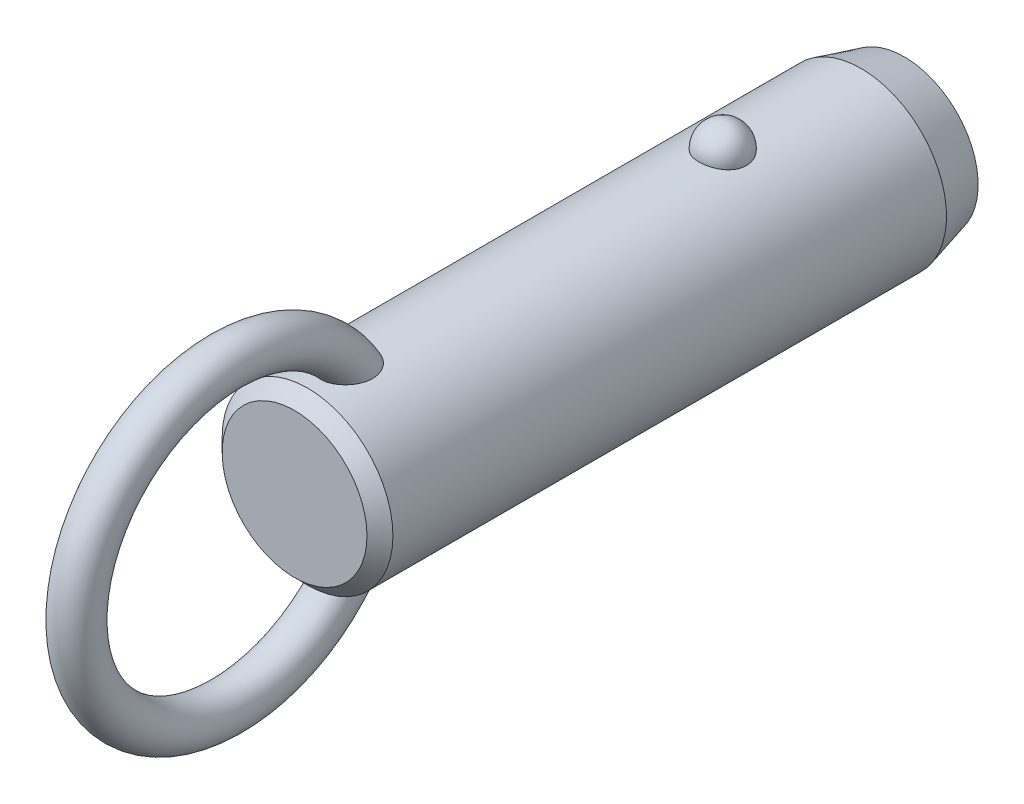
ISO-10303-21;
HEADER;
FILE_DESCRIPTION(('STEP AP214'),'2;1');
FILE_NAME('part.step','',(''),(''),'','','');
FILE_SCHEMA(('AUTOMOTIVE_DESIGN { 1 0 10303 214 1 1 1 1 }'));
ENDSEC;
DATA;
#1=APPLICATION_CONTEXT('core data for automotive mechanical design processes');
#2=APPLICATION_PROTOCOL_DEFINITION('international standard','automotive_design',2000,#1);
#3=PRODUCT_CONTEXT('',#1,'mechanical');
#4=PRODUCT('Part','Part','',(#3));
#5=PRODUCT_RELATED_PRODUCT_CATEGORY('part','',(#4));
#6=PRODUCT_DEFINITION_FORMATION('','',#4);
#7=PRODUCT_DEFINITION_CONTEXT('part definition',#1,'design');
#8=PRODUCT_DEFINITION('design','',#6,#7);
#9=PRODUCT_DEFINITION_SHAPE('','',#8);
#10=(LENGTH_UNIT() NAMED_UNIT(*) SI_UNIT(.MILLI.,.METRE.));
#11=(NAMED_UNIT(*) PLANE_ANGLE_UNIT() SI_UNIT($,.RADIAN.));
#12=(NAMED_UNIT(*) SI_UNIT($,.STERADIAN.) SOLID_ANGLE_UNIT());
#13=UNCERTAINTY_MEASURE_WITH_UNIT(LENGTH_MEASURE(1.E-05),#10,'distance_accuracy_value','');
#14=(GEOMETRIC_REPRESENTATION_CONTEXT(3) GLOBAL_UNCERTAINTY_ASSIGNED_CONTEXT((#13)) GLOBAL_UNIT_ASSIGNED_CONTEXT((#10,
#11,#12)) REPRESENTATION_CONTEXT('',''));
#15=CARTESIAN_POINT('',(0.,0.,0.));
#16=DIRECTION('',(0.,0.,1.));
#17=DIRECTION('',(1.,0.,0.));
#18=AXIS2_PLACEMENT_3D('',#15,#16,#17);
#19=CARTESIAN_POINT('',(0.,0.,27.9));
#20=DIRECTION('',(0.,0.,-1.));
#21=DIRECTION('',(-1.,0.,0.));
#22=AXIS2_PLACEMENT_3D('',#19,#20,#21);
#23=CYLINDRICAL_SURFACE('',#22,7.9);
#24=CARTESIAN_POINT('',(2.1785689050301,7.59367088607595,-2.20000000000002));
#25=CARTESIAN_POINT('',(2.17856679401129,7.59367269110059,-2.07701843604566));
#26=CARTESIAN_POINT('',(2.16853481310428,7.59657145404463,-1.95401006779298));
#27=CARTESIAN_POINT('',(2.12864689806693,7.607843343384,-1.71147811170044));
#28=CARTESIAN_POINT('',(2.09878338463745,7.61621856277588,-1.5919558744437));
#29=CARTESIAN_POINT('',(2.0199931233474,7.63749180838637,-1.35985638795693));
#30=CARTESIAN_POINT('',(1.97107475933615,7.6503878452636,-1.24727610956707));
#31=CARTESIAN_POINT('',(1.85539377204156,7.67926115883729,-1.03213234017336));
#32=CARTESIAN_POINT('',(1.78863158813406,7.69523835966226,-0.929568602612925));
#33=CARTESIAN_POINT('',(1.63856494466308,7.7285848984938,-0.73678633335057));
#34=CARTESIAN_POINT('',(1.55518140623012,7.7459606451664,-0.646630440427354));
#35=CARTESIAN_POINT('',(1.37422937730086,7.78009978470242,-0.481747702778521));
#36=CARTESIAN_POINT('',(1.27666086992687,7.79686317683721,-0.407020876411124));
#37=CARTESIAN_POINT('',(1.07024728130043,7.82786153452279,-0.275278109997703));
#38=CARTESIAN_POINT('',(0.961434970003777,7.84210353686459,-0.218212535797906));
#39=CARTESIAN_POINT('',(0.735351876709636,7.86652194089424,-0.123146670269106));
#40=CARTESIAN_POINT('',(0.618082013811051,7.87669878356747,-0.0851443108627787));
#41=CARTESIAN_POINT('',(0.380637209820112,7.89170521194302,-0.0298158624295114));
#42=CARTESIAN_POINT('',(0.260550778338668,7.89662650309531,-0.0121347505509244));
#43=CARTESIAN_POINT('',(0.0190117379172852,7.90090003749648,0.00324379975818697));
#44=CARTESIAN_POINT('',(-0.102440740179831,7.90025280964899,0.000943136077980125));
#45=CARTESIAN_POINT('',(-0.341452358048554,7.89351056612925,-0.0233955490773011));
#46=CARTESIAN_POINT('',(-0.459042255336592,7.88749257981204,-0.0451545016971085));
#47=CARTESIAN_POINT('',(-0.688796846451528,7.87075812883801,-0.107408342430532));
#48=CARTESIAN_POINT('',(-0.800961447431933,7.86004158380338,-0.14790355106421));
#49=CARTESIAN_POINT('',(-1.01743634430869,7.83497131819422,-0.246799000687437));
#50=CARTESIAN_POINT('',(-1.12169791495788,7.82059709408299,-0.305300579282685));
#51=CARTESIAN_POINT('',(-1.31891765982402,7.78976470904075,-0.43854939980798));
#52=CARTESIAN_POINT('',(-1.41187469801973,7.77330633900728,-0.513298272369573));
#53=CARTESIAN_POINT('',(-1.58577142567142,7.73972434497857,-0.678622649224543));
#54=CARTESIAN_POINT('',(-1.66645140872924,7.72259402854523,-0.769470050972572));
#55=CARTESIAN_POINT('',(-1.81161503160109,7.68983776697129,-0.963538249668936));
#56=CARTESIAN_POINT('',(-1.87609753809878,7.6742119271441,-1.0667599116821));
#57=CARTESIAN_POINT('',(-1.98790138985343,7.6460202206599,-1.28401170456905));
#58=CARTESIAN_POINT('',(-2.03501994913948,7.63349104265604,-1.39815107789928));
#59=CARTESIAN_POINT('',(-2.10986724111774,7.6131449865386,-1.6330178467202));
#60=CARTESIAN_POINT('',(-2.1375965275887,7.60532797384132,-1.75374505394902));
#61=CARTESIAN_POINT('',(-2.17289256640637,7.5953195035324,-1.99782562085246));
#62=CARTESIAN_POINT('',(-2.18054294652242,7.59310471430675,-2.12116592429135));
#63=CARTESIAN_POINT('',(-2.17572919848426,7.59448538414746,-2.36741799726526));
#64=CARTESIAN_POINT('',(-2.1632656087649,7.59808068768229,-2.49032977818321));
#65=CARTESIAN_POINT('',(-2.11865035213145,7.61064035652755,-2.73161015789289));
#66=CARTESIAN_POINT('',(-2.08659579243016,7.61957823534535,-2.84999812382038));
#67=CARTESIAN_POINT('',(-2.00367799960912,7.64179982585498,-3.07955956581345));
#68=CARTESIAN_POINT('',(-1.9528140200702,7.65508371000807,-3.19073275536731));
#69=CARTESIAN_POINT('',(-1.83321113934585,7.68460381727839,-3.40337899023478));
#70=CARTESIAN_POINT('',(-1.76437735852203,7.70085556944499,-3.5047965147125));
#71=CARTESIAN_POINT('',(-1.61069526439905,7.73445734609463,-3.69446912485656));
#72=CARTESIAN_POINT('',(-1.52584634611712,7.75180741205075,-3.78272371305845));
#73=CARTESIAN_POINT('',(-1.34198059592,7.78574608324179,-3.94393987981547));
#74=CARTESIAN_POINT('',(-1.24291308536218,7.80233167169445,-4.01684434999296));
#75=CARTESIAN_POINT('',(-1.03352039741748,7.83281625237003,-4.14489386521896));
#76=CARTESIAN_POINT('',(-0.92319600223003,7.84671543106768,-4.20004014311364));
#77=CARTESIAN_POINT('',(-0.695822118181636,7.87011575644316,-4.29042017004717));
#78=CARTESIAN_POINT('',(-0.578872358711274,7.87966903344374,-4.32589112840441));
#79=CARTESIAN_POINT('',(-0.340410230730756,7.8935652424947,-4.37692226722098));
#80=CARTESIAN_POINT('',(-0.218898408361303,7.89790879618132,-4.39248482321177));
#81=CARTESIAN_POINT('',(0.0228107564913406,7.90087453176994,-4.40314405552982));
#82=CARTESIAN_POINT('',(0.142990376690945,7.89960185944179,-4.39861683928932));
#83=CARTESIAN_POINT('',(0.380829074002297,7.89171262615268,-4.37008293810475));
#84=CARTESIAN_POINT('',(0.498488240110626,7.8850962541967,-4.34607694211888));
#85=CARTESIAN_POINT('',(0.727535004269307,7.86726442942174,-4.27939317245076));
#86=CARTESIAN_POINT('',(0.838944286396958,7.85606616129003,-4.23678512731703));
#87=CARTESIAN_POINT('',(1.05295421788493,7.83025654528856,-4.13408348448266));
#88=CARTESIAN_POINT('',(1.15555431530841,7.81564498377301,-4.07398879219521));
#89=CARTESIAN_POINT('',(1.35076763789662,7.7843022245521,-3.93687432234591));
#90=CARTESIAN_POINT('',(1.4432046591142,7.76754209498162,-3.85961036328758));
#91=CARTESIAN_POINT('',(1.6139111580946,7.73387857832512,-3.69076949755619));
#92=CARTESIAN_POINT('',(1.6921781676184,7.71697516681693,-3.59919010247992));
#93=CARTESIAN_POINT('',(1.83380875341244,7.6845643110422,-3.40247278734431));
#94=CARTESIAN_POINT('',(1.89689280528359,7.66908588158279,-3.29712873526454));
#95=CARTESIAN_POINT('',(2.0047823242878,7.64159441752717,-3.07707931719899));
#96=CARTESIAN_POINT('',(2.0495945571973,7.62958010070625,-2.96237743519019));
#97=CARTESIAN_POINT('',(2.11580183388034,7.61146617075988,-2.74040519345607));
#98=CARTESIAN_POINT('',(2.13929812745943,7.60484503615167,-2.63379846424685));
#99=CARTESIAN_POINT('',(2.17068242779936,7.59594664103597,-2.4181348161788));
#100=CARTESIAN_POINT('',(2.17857077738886,7.59366928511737,-2.30907795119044));
#101=CARTESIAN_POINT('',(2.1785689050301,7.59367088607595,-2.20000000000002));
#102=B_SPLINE_CURVE_WITH_KNOTS('',3,(#24,#25,#26,#27,#28,#29,#30,#31,#32,#33,#34,#35,#36,#37,
#38,#39,#40,#41,#42,#43,#44,#45,#46,#47,#48,#49,#50,#51,#52,#53,#54,#55,#56,#57,#58,#59,#60,#61,
#62,#63,#64,#65,#66,#67,#68,#69,#70,#71,#72,#73,#74,#75,#76,#77,#78,#79,#80,#81,#82,#83,#84,#85,
#86,#87,#88,#89,#90,#91,#92,#93,#94,#95,#96,#97,#98,#99,#100,#101),.UNSPECIFIED.,.T.,.F.,(4,2,2,
2,2,2,2,2,2,2,2,2,2,2,2,2,2,2,2,2,2,2,2,2,2,2,2,2,2,2,2,2,2,2,2,2,2,2,4),(0.,0.368552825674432,
0.737246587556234,1.10577831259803,1.4743009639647,1.8446206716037,2.21494081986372,
2.5842105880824,2.95344028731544,3.31611630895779,3.67875788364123,4.03628044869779,
4.39380913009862,4.75338791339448,5.11300280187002,5.47939989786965,5.8458226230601,
6.21639834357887,6.58696347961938,6.95598276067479,7.32499216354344,7.69218715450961,
8.0593967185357,8.42858578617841,8.79778880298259,9.16834203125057,9.5388695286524,
9.90482699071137,10.2707407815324,10.6298333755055,10.9889132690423,11.3466585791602,
11.7044262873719,12.0676511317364,12.4309391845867,12.8004764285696,13.1698767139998,
13.4967701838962,13.8236564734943),.UNSPECIFIED.);
#103=CARTESIAN_POINT('',(2.1785689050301,7.59367088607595,-2.20000000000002));
#104=VERTEX_POINT('',#103);
#105=EDGE_CURVE('E41',#104,#104,#102,.T.);
#106=ORIENTED_EDGE('',*,*,#105,.T.);
#107=EDGE_LOOP('',(#106));
#108=FACE_BOUND('',#107,.T.);
#109=CARTESIAN_POINT('',(0.,0.,36.22));
#110=DIRECTION('',(0.,0.,1.));
#111=DIRECTION('',(1.,0.,0.));
#112=AXIS2_PLACEMENT_3D('',#109,#110,#111);
#113=CIRCLE('',#112,7.9);
#114=CARTESIAN_POINT('',(7.9,0.,36.22));
#115=VERTEX_POINT('',#114);
#116=EDGE_CURVE('E10',#115,#115,#113,.F.);
#117=ORIENTED_EDGE('',*,*,#116,.T.);
#118=EDGE_LOOP('',(#117));
#119=FACE_BOUND('',#118,.T.);
#120=CARTESIAN_POINT('',(-0.630969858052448,-7.87476203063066,30.1124322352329));
#121=CARTESIAN_POINT('',(-0.734180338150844,-7.8664899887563,30.147285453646));
#122=CARTESIAN_POINT('',(-0.834476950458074,-7.85639291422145,30.1908160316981));
#123=CARTESIAN_POINT('',(-1.0262035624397,-7.83366343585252,30.294094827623));
#124=CARTESIAN_POINT('',(-1.1176141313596,-7.82102565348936,30.3538775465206));
#125=CARTESIAN_POINT('',(-1.28877277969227,-7.79464922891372,30.4878390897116));
#126=CARTESIAN_POINT('',(-1.36854014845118,-7.78091246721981,30.561993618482));
#127=CARTESIAN_POINT('',(-1.51461521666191,-7.75380398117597,30.7224941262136));
#128=CARTESIAN_POINT('',(-1.58092966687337,-7.74043207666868,30.8088339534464));
#129=CARTESIAN_POINT('',(-1.70019064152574,-7.71512522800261,30.9929784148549));
#130=CARTESIAN_POINT('',(-1.75284037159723,-7.70322473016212,31.0909792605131));
#131=CARTESIAN_POINT('',(-1.84263464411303,-7.68224112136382,31.2941029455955));
#132=CARTESIAN_POINT('',(-1.87977299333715,-7.6731591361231,31.3992286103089));
#133=CARTESIAN_POINT('',(-1.94152728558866,-7.65777930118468,31.6232849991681));
#134=CARTESIAN_POINT('',(-1.96475471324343,-7.65179654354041,31.7426167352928));
#135=CARTESIAN_POINT('',(-1.99449499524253,-7.64409642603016,31.9834298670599));
#136=CARTESIAN_POINT('',(-2.0010005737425,-7.64238092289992,32.1049121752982));
#137=CARTESIAN_POINT('',(-1.99856014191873,-7.64302120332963,32.3683409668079));
#138=CARTESIAN_POINT('',(-1.98680021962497,-7.64611845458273,32.5102565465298));
#139=CARTESIAN_POINT('',(-1.94457772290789,-7.65696186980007,32.7911188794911));
#140=CARTESIAN_POINT('',(-1.91409393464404,-7.66471330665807,32.9300620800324));
#141=CARTESIAN_POINT('',(-1.82768670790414,-7.68582947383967,33.231939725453));
#142=CARTESIAN_POINT('',(-1.76772963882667,-7.70003779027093,33.393686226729));
#143=CARTESIAN_POINT('',(-1.65998501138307,-7.72371550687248,33.6276956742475));
#144=CARTESIAN_POINT('',(-1.62107967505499,-7.73200670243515,33.7042974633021));
#145=CARTESIAN_POINT('',(-1.53727726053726,-7.7491037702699,33.8540798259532));
#146=CARTESIAN_POINT('',(-1.4923821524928,-7.75790947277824,33.9272615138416));
#147=CARTESIAN_POINT('',(-1.37397050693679,-7.77993338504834,34.1028838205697));
#148=CARTESIAN_POINT('',(-1.29690364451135,-7.79328473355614,34.2029557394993));
#149=CARTESIAN_POINT('',(-1.12885487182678,-7.81939266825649,34.3907147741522));
#150=CARTESIAN_POINT('',(-1.03789926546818,-7.83215032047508,34.4784247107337));
#151=CARTESIAN_POINT('',(-0.869532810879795,-7.85231710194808,34.6134148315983));
#152=CARTESIAN_POINT('',(-0.795716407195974,-7.86021093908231,34.665076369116));
#153=CARTESIAN_POINT('',(-0.640813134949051,-7.87434920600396,34.7563815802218));
#154=CARTESIAN_POINT('',(-0.559737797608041,-7.88059619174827,34.7960438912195));
#155=CARTESIAN_POINT('',(-0.406456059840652,-7.88984116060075,34.8543008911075));
#156=CARTESIAN_POINT('',(-0.335227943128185,-7.89321892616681,34.8753848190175));
#157=CARTESIAN_POINT('',(-0.190193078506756,-7.89804235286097,34.9054141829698));
#158=CARTESIAN_POINT('',(-0.116388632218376,-7.89948969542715,34.9143701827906));
#159=CARTESIAN_POINT('',(0.0318414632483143,-7.90028409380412,34.9192915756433));
#160=CARTESIAN_POINT('',(0.106268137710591,-7.89962640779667,34.9152276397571));
#161=CARTESIAN_POINT('',(0.253290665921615,-7.8962818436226,34.8944615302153));
#162=CARTESIAN_POINT('',(0.325885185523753,-7.8935935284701,34.8777504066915));
#163=CARTESIAN_POINT('',(0.481441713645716,-7.88577340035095,34.8287380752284));
#164=CARTESIAN_POINT('',(0.563611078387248,-7.88026321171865,34.794005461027));
#165=CARTESIAN_POINT('',(0.721129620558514,-7.86741729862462,34.7117965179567));
#166=CARTESIAN_POINT('',(0.796466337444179,-7.86007832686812,34.6642975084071));
#167=CARTESIAN_POINT('',(0.97145628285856,-7.84073285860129,34.536513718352));
#168=CARTESIAN_POINT('',(1.06719686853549,-7.82809461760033,34.4510047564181));
#169=CARTESIAN_POINT('',(1.24418921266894,-7.80192439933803,34.266232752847));
#170=CARTESIAN_POINT('',(1.32540832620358,-7.78839049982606,34.1669395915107));
#171=CARTESIAN_POINT('',(1.45199971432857,-7.76559693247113,33.9895760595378));
#172=CARTESIAN_POINT('',(1.5008564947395,-7.75626094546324,33.9139542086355));
#173=CARTESIAN_POINT('',(1.59197749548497,-7.7380727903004,33.7587428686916));
#174=CARTESIAN_POINT('',(1.63423919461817,-7.72922080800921,33.6791518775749));
#175=CARTESIAN_POINT('',(1.71222612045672,-7.71231959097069,33.5166640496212));
#176=CARTESIAN_POINT('',(1.7479451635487,-7.70427111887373,33.4337641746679));
#177=CARTESIAN_POINT('',(1.81270113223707,-7.68929240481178,33.2652967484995));
#178=CARTESIAN_POINT('',(1.84173789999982,-7.68236218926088,33.1797291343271));
#179=CARTESIAN_POINT('',(1.89322698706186,-7.6698375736,33.0052870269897));
#180=CARTESIAN_POINT('',(1.91558744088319,-7.66426199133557,32.9163838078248));
#181=CARTESIAN_POINT('',(1.95281367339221,-7.65485915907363,32.7369696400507));
#182=CARTESIAN_POINT('',(1.96767946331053,-7.65103190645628,32.6464586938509));
#183=CARTESIAN_POINT('',(2.00021456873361,-7.64262981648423,32.3737320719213));
#184=CARTESIAN_POINT('',(2.00600691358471,-7.6410871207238,32.1897099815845));
#185=CARTESIAN_POINT('',(1.98445334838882,-7.64669564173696,31.8765019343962));
#186=CARTESIAN_POINT('',(1.96607186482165,-7.65149688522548,31.746618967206));
#187=CARTESIAN_POINT('',(1.90884967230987,-7.6659762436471,31.4916321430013));
#188=CARTESIAN_POINT('',(1.87002101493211,-7.67565148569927,31.366525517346));
#189=CARTESIAN_POINT('',(1.77063986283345,-7.69918471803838,31.1245401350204));
#190=CARTESIAN_POINT('',(1.7099372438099,-7.71307150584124,31.0077250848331));
#191=CARTESIAN_POINT('',(1.56733070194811,-7.74330306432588,30.7881444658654));
#192=CARTESIAN_POINT('',(1.4854369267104,-7.75964665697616,30.6853722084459));
#193=CARTESIAN_POINT('',(1.31346177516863,-7.79047523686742,30.5093800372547));
#194=CARTESIAN_POINT('',(1.22547278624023,-7.80495298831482,30.4341066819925));
#195=CARTESIAN_POINT('',(1.03724352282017,-7.83218597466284,30.3004864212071));
#196=CARTESIAN_POINT('',(0.937008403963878,-7.84494192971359,30.2421324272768));
#197=CARTESIAN_POINT('',(0.733599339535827,-7.86649045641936,30.1470270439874));
#198=CARTESIAN_POINT('',(0.630941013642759,-7.87547134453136,30.1092109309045));
#199=CARTESIAN_POINT('',(0.420465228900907,-7.88950708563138,30.0511160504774));
#200=CARTESIAN_POINT('',(0.312645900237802,-7.89456050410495,30.0308436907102));
#201=CARTESIAN_POINT('',(0.0960869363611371,-7.9001518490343,30.0084559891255));
#202=CARTESIAN_POINT('',(-0.012634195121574,-7.90073226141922,30.0061698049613));
#203=CARTESIAN_POINT('',(-0.228766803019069,-7.89742350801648,30.0193678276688));
#204=CARTESIAN_POINT('',(-0.336180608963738,-7.89354403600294,30.0348134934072));
#205=CARTESIAN_POINT('',(-0.473410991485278,-7.88586871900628,30.0662177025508));
#206=CARTESIAN_POINT('',(-0.505257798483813,-7.88388984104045,30.0743541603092));
#207=CARTESIAN_POINT('',(-0.568481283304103,-7.87958326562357,30.0922083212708));
#208=CARTESIAN_POINT('',(-0.599857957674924,-7.87725556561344,30.1019260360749));
#209=CARTESIAN_POINT('',(-0.630969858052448,-7.87476203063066,30.1124322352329));
#210=B_SPLINE_CURVE_WITH_KNOTS('',3,(#120,#121,#122,#123,#124,#125,#126,#127,#128,#129,#130,
#131,#132,#133,#134,#135,#136,#137,#138,#139,#140,#141,#142,#143,#144,#145,#146,#147,#148,#149,
#150,#151,#152,#153,#154,#155,#156,#157,#158,#159,#160,#161,#162,#163,#164,#165,#166,#167,#168,
#169,#170,#171,#172,#173,#174,#175,#176,#177,#178,#179,#180,#181,#182,#183,#184,#185,#186,#187,
#188,#189,#190,#191,#192,#193,#194,#195,#196,#197,#198,#199,#200,#201,#202,#203,#204,#205,#206,
#207,#208,#209),.UNSPECIFIED.,.T.,.F.,(4,2,2,2,2,2,2,2,2,2,2,2,2,2,2,2,2,2,2,2,2,2,2,2,2,2,2,2,
2,2,2,2,2,2,2,2,2,2,2,2,2,2,2,2,4),(0.,0.327622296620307,0.655945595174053,0.983718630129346,
1.3113267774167,1.64554655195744,1.97989964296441,2.34365728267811,2.70757317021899,
3.13333684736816,3.55958380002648,4.07655306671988,4.33527897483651,4.59391999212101,
4.97382437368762,5.35301797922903,5.62348245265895,5.89352465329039,6.11565959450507,
6.33760092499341,6.56004255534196,6.78264174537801,7.04930844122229,7.31645206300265,
7.70130871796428,8.08701995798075,8.35824509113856,8.62957365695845,8.90115735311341,
9.17274746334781,9.44791855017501,9.72308922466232,10.2715298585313,10.6638393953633,
11.0559179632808,11.4507403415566,11.845374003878,12.1936425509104,12.5417649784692,
12.8695063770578,13.1973674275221,13.5221104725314,13.8461490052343,13.9449071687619,
14.0436660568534),.UNSPECIFIED.);
#211=CARTESIAN_POINT('',(-0.630969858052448,-7.87476203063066,30.1124322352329));
#212=VERTEX_POINT('',#211);
#213=EDGE_CURVE('E60',#212,#212,#210,.T.);
#214=ORIENTED_EDGE('',*,*,#213,.T.);
#215=EDGE_LOOP('',(#214));
#216=FACE_BOUND('',#215,.T.);
#217=CARTESIAN_POINT('',(-0.630969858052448,7.87476203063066,30.1124322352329));
#218=CARTESIAN_POINT('',(-0.528918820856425,7.88293636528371,30.0779798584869));
#219=CARTESIAN_POINT('',(-0.423745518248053,7.88934810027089,30.051915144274));
#220=CARTESIAN_POINT('',(-0.210236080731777,7.8979273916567,30.0172825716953));
#221=CARTESIAN_POINT('',(-0.101893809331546,7.90008607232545,30.0087513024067));
#222=CARTESIAN_POINT('',(0.114660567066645,7.89990877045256,30.0094570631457));
#223=CARTESIAN_POINT('',(0.22287270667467,7.89757640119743,30.0186798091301));
#224=CARTESIAN_POINT('',(0.436107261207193,7.88867538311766,30.0546525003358));
#225=CARTESIAN_POINT('',(0.541131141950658,7.8821087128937,30.0813942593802));
#226=CARTESIAN_POINT('',(0.745085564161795,7.86545130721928,30.1517561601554));
#227=CARTESIAN_POINT('',(0.844015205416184,7.85536005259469,30.1953787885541));
#228=CARTESIAN_POINT('',(1.03299167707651,7.83275153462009,30.2983796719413));
#229=CARTESIAN_POINT('',(1.12303841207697,7.8202342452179,30.3577580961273));
#230=CARTESIAN_POINT('',(1.29214734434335,7.79408219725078,30.4908647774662));
#231=CARTESIAN_POINT('',(1.37116907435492,7.78044359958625,30.5646436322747));
#232=CARTESIAN_POINT('',(1.51597677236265,7.75353170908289,30.7242353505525));
#233=CARTESIAN_POINT('',(1.58176261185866,7.74025841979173,30.8100483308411));
#234=CARTESIAN_POINT('',(1.70057386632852,7.71504069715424,30.993644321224));
#235=CARTESIAN_POINT('',(1.75320073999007,7.7031425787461,31.0916906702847));
#236=CARTESIAN_POINT('',(1.8429376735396,7.68216822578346,31.2948931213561));
#237=CARTESIAN_POINT('',(1.88004278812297,7.67309289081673,31.4000514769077));
#238=CARTESIAN_POINT('',(1.9417232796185,7.6577294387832,31.6241671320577));
#239=CARTESIAN_POINT('',(1.96491037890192,7.65175648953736,31.7435248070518));
#240=CARTESIAN_POINT('',(1.9945689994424,7.64407702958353,31.9843848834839));
#241=CARTESIAN_POINT('',(2.00103304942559,7.64237242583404,32.1058882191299));
#242=CARTESIAN_POINT('',(1.99850166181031,7.64303650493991,32.3693688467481));
#243=CARTESIAN_POINT('',(1.98669038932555,7.64614714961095,32.5113141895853));
#244=CARTESIAN_POINT('',(1.94436120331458,7.6570170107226,32.7922287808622));
#245=CARTESIAN_POINT('',(1.91382203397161,7.66478150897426,32.9311944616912));
#246=CARTESIAN_POINT('',(1.82728754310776,7.68592483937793,33.2331110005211));
#247=CARTESIAN_POINT('',(1.76725778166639,7.7001468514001,33.3948721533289));
#248=CARTESIAN_POINT('',(1.65939700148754,7.72384204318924,33.6288914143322));
#249=CARTESIAN_POINT('',(1.62045187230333,7.73213852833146,33.7054942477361));
#250=CARTESIAN_POINT('',(1.5365668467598,7.74924489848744,33.8552737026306));
#251=CARTESIAN_POINT('',(1.49162892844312,7.75805461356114,33.9284514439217));
#252=CARTESIAN_POINT('',(1.37317698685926,7.78007342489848,34.1039520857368));
#253=CARTESIAN_POINT('',(1.29612360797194,7.79341423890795,34.2039112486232));
#254=CARTESIAN_POINT('',(1.12812043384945,7.81949839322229,34.3914508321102));
#255=CARTESIAN_POINT('',(1.03719688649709,7.83224280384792,34.4790540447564));
#256=CARTESIAN_POINT('',(0.868871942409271,7.85239026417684,34.6138971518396));
#257=CARTESIAN_POINT('',(0.795056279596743,7.86027769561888,34.6655113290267));
#258=CARTESIAN_POINT('',(0.640160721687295,7.87440222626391,34.7567201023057));
#259=CARTESIAN_POINT('',(0.559092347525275,7.88064188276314,34.7963333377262));
#260=CARTESIAN_POINT('',(0.40582092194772,7.8898738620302,34.8545056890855));
#261=CARTESIAN_POINT('',(0.334594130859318,7.89324577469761,34.8755523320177));
#262=CARTESIAN_POINT('',(0.189568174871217,7.89805733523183,34.9055070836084));
#263=CARTESIAN_POINT('',(0.115771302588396,7.89949866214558,34.9144257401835));
#264=CARTESIAN_POINT('',(-0.0324359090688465,7.90028156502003,34.9192758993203));
#265=CARTESIAN_POINT('',(-0.106847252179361,7.89961843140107,34.9151782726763));
#266=CARTESIAN_POINT('',(-0.253834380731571,7.8962642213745,34.8943519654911));
#267=CARTESIAN_POINT('',(-0.326408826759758,7.89357170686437,34.8776143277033));
#268=CARTESIAN_POINT('',(-0.481962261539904,7.88574179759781,34.8285391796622));
#269=CARTESIAN_POINT('',(-0.564145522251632,7.88022507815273,34.7937638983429));
#270=CARTESIAN_POINT('',(-0.721685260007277,7.8673664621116,34.7114686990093));
#271=CARTESIAN_POINT('',(-0.797029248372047,7.8600213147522,34.6639260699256));
#272=CARTESIAN_POINT('',(-0.972044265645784,7.84066026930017,34.5360267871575));
#273=CARTESIAN_POINT('',(-1.06779803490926,7.82801274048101,34.4504436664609));
#274=CARTESIAN_POINT('',(-1.24480531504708,7.80182621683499,34.2655223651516));
#275=CARTESIAN_POINT('',(-1.32602618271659,7.78828530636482,34.1661540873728));
#276=CARTESIAN_POINT('',(-1.45259834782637,7.76548487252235,33.9886806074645));
#277=CARTESIAN_POINT('',(-1.50143856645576,7.75614818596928,33.9130252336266));
#278=CARTESIAN_POINT('',(-1.59252410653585,7.73796020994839,33.7577484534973));
#279=CARTESIAN_POINT('',(-1.63476690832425,7.72910910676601,33.6781255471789));
#280=CARTESIAN_POINT('',(-1.71271318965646,7.71221133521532,33.5155750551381));
#281=CARTESIAN_POINT('',(-1.74841047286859,7.70416543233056,33.4326444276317));
#282=CARTESIAN_POINT('',(-1.81311929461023,7.68919371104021,33.2641168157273));
#283=CARTESIAN_POINT('',(-1.84213067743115,7.6822679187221,33.1785197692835));
#284=CARTESIAN_POINT('',(-1.89356259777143,7.66975461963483,33.0040254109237));
#285=CARTESIAN_POINT('',(-1.91589165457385,7.66418586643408,32.9150995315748));
#286=CARTESIAN_POINT('',(-1.95305070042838,7.65479859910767,32.7356424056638));
#287=CARTESIAN_POINT('',(-1.96788069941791,7.65098008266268,32.6451111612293));
#288=CARTESIAN_POINT('',(-2.00030078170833,7.64260704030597,32.3723270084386));
#289=CARTESIAN_POINT('',(-2.00600576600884,7.64108760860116,32.1882718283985));
#290=CARTESIAN_POINT('',(-1.98428483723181,7.64673945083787,31.8750800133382));
#291=CARTESIAN_POINT('',(-1.96583698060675,7.6515575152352,31.7452400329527));
#292=CARTESIAN_POINT('',(-1.90848948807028,7.66606613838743,31.4903619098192));
#293=CARTESIAN_POINT('',(-1.86960376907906,7.67575338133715,31.365320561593));
#294=CARTESIAN_POINT('',(-1.7701342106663,7.6993013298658,31.1235009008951));
#295=CARTESIAN_POINT('',(-1.70940488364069,7.71318991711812,31.0067844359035));
#296=CARTESIAN_POINT('',(-1.56672953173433,7.74342495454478,30.7873404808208));
#297=CARTESIAN_POINT('',(-1.48478316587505,7.75977144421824,30.6846132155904));
#298=CARTESIAN_POINT('',(-1.31266325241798,7.79061163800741,30.508643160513));
#299=CARTESIAN_POINT('',(-1.22456383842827,7.80509908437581,30.4333589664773));
#300=CARTESIAN_POINT('',(-1.03622400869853,7.83231881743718,30.2998659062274));
#301=CARTESIAN_POINT('',(-0.936015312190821,7.84505551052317,30.2416137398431));
#302=CARTESIAN_POINT('',(-0.798824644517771,7.85957802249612,30.1775408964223));
#303=CARTESIAN_POINT('',(-0.765787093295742,7.86286821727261,30.1632248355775));
#304=CARTESIAN_POINT('',(-0.698939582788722,7.86909211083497,30.136436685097));
#305=CARTESIAN_POINT('',(-0.665129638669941,7.8720258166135,30.1239645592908));
#306=CARTESIAN_POINT('',(-0.630969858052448,7.87476203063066,30.1124322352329));
#307=B_SPLINE_CURVE_WITH_KNOTS('',3,(#217,#218,#219,#220,#221,#222,#223,#224,#225,#226,#227,
#228,#229,#230,#231,#232,#233,#234,#235,#236,#237,#238,#239,#240,#241,#242,#243,#244,#245,#246,
#247,#248,#249,#250,#251,#252,#253,#254,#255,#256,#257,#258,#259,#260,#261,#262,#263,#264,#265,
#266,#267,#268,#269,#270,#271,#272,#273,#274,#275,#276,#277,#278,#279,#280,#281,#282,#283,#284,
#285,#286,#287,#288,#289,#290,#291,#292,#293,#294,#295,#296,#297,#298,#299,#300,#301,#302,#303,
#304,#305,#306),.UNSPECIFIED.,.T.,.F.,(4,2,2,2,2,2,2,2,2,2,2,2,2,2,2,2,2,2,2,2,2,2,2,2,2,2,2,2,
2,2,2,2,2,2,2,2,2,2,2,2,2,2,2,2,4),(0.,0.323920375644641,0.648516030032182,0.972850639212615,
1.29703380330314,1.62126473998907,1.94549915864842,2.27089401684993,2.5962920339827,
2.93059633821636,3.26500707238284,3.6288164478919,3.99278833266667,4.4186542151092,
4.84500434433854,5.36209210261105,5.62087589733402,5.87957448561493,6.25918598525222,
6.6380878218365,6.90846748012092,7.17842501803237,7.40052350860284,7.62242871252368,
7.84483086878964,8.06739077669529,8.33414615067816,8.60137921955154,8.98641454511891,
9.37230415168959,9.6435867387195,9.91497268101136,10.1866142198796,10.4582620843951,
10.7334745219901,11.0086865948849,11.5572126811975,11.9494246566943,12.3413699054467,
12.7359755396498,13.1305875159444,13.4791770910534,13.82687259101,13.9353013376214,
14.0437279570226),.UNSPECIFIED.);
#308=CARTESIAN_POINT('',(-0.630969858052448,7.87476203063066,30.1124322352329));
#309=VERTEX_POINT('',#308);
#310=EDGE_CURVE('E68',#309,#309,#307,.T.);
#311=ORIENTED_EDGE('',*,*,#310,.T.);
#312=EDGE_LOOP('',(#311));
#313=FACE_BOUND('',#312,.T.);
#314=CARTESIAN_POINT('',(0.,0.,-14.9999999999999));
#315=DIRECTION('',(0.,0.,-1.));
#316=DIRECTION('',(-1.,0.,0.));
#317=AXIS2_PLACEMENT_3D('',#314,#315,#316);
#318=CIRCLE('',#317,7.9);
#319=CARTESIAN_POINT('',(-7.9,0.,-14.9999999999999));
#320=VERTEX_POINT('',#319);
#321=EDGE_CURVE('E57',#320,#320,#318,.F.);
#322=ORIENTED_EDGE('',*,*,#321,.T.);
#323=EDGE_LOOP('',(#322));
#324=FACE_BOUND('',#323,.T.);
#325=ADVANCED_FACE('F37',(#108,#119,#216,#313,#324),#23,.T.);
#326=CARTESIAN_POINT('',(0.,0.,-19.));
#327=DIRECTION('',(0.,0.,-1.));
#328=DIRECTION('',(-1.,0.,0.));
#329=AXIS2_PLACEMENT_3D('',#326,#327,#328);
#330=PLANE('',#329);
#331=CARTESIAN_POINT('',(0.,0.,-19.));
#332=DIRECTION('',(0.,0.,-1.));
#333=DIRECTION('',(-1.,0.,0.));
#334=AXIS2_PLACEMENT_3D('',#331,#332,#333);
#335=CIRCLE('',#334,6.8282032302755);
#336=CARTESIAN_POINT('',(-6.8282032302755,0.,-19.));
#337=VERTEX_POINT('',#336);
#338=EDGE_CURVE('E67',#337,#337,#335,.T.);
#339=ORIENTED_EDGE('',*,*,#338,.T.);
#340=EDGE_LOOP('',(#339));
#341=FACE_BOUND('',#340,.T.);
#342=ADVANCED_FACE('F86',(#341),#330,.T.);
#343=CARTESIAN_POINT('',(0.,0.,-19.));
#344=DIRECTION('',(0.,0.,1.));
#345=DIRECTION('',(1.,0.,0.));
#346=AXIS2_PLACEMENT_3D('',#343,#344,#345);
#347=CONICAL_SURFACE('',#346,6.8282032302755,0.261799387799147);
#348=ORIENTED_EDGE('',*,*,#321,.F.);
#349=EDGE_LOOP('',(#348));
#350=FACE_BOUND('',#349,.T.);
#351=ORIENTED_EDGE('',*,*,#338,.F.);
#352=EDGE_LOOP('',(#351));
#353=FACE_BOUND('',#352,.T.);
#354=ADVANCED_FACE('F84',(#350,#353),#347,.T.);
#355=CARTESIAN_POINT('',(0.,0.,37.42));
#356=DIRECTION('',(0.,0.,1.));
#357=DIRECTION('',(1.,0.,0.));
#358=AXIS2_PLACEMENT_3D('',#355,#356,#357);
#359=PLANE('',#358);
#360=CARTESIAN_POINT('',(0.,0.,37.42));
#361=DIRECTION('',(0.,0.,1.));
#362=DIRECTION('',(1.,0.,0.));
#363=AXIS2_PLACEMENT_3D('',#360,#361,#362);
#364=CIRCLE('',#363,6.70000000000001);
#365=CARTESIAN_POINT('',(6.70000000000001,0.,37.42));
#366=VERTEX_POINT('',#365);
#367=EDGE_CURVE('E50',#366,#366,#364,.T.);
#368=ORIENTED_EDGE('',*,*,#367,.T.);
#369=EDGE_LOOP('',(#368));
#370=FACE_BOUND('',#369,.T.);
#371=ADVANCED_FACE('F78',(#370),#359,.T.);
#372=CARTESIAN_POINT('',(0.,0.,43.75));
#373=DIRECTION('',(1.,0.,0.));
#374=DIRECTION('',(0.,0.,-1.));
#375=AXIS2_PLACEMENT_3D('',#372,#373,#374);
#376=TOROIDAL_SURFACE('',#375,13.85,2.);
#377=ORIENTED_EDGE('',*,*,#310,.F.);
#378=EDGE_LOOP('',(#377));
#379=FACE_BOUND('',#378,.T.);
#380=ORIENTED_EDGE('',*,*,#213,.F.);
#381=EDGE_LOOP('',(#380));
#382=FACE_BOUND('',#381,.T.);
#383=ADVANCED_FACE('F74',(#379,#382),#376,.T.);
#384=CARTESIAN_POINT('',(0.,0.,37.42));
#385=DIRECTION('',(0.,0.,-1.));
#386=DIRECTION('',(-1.,0.,0.));
#387=AXIS2_PLACEMENT_3D('',#384,#385,#386);
#388=CONICAL_SURFACE('',#387,6.70000000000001,0.78539816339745);
#389=ORIENTED_EDGE('',*,*,#116,.F.);
#390=EDGE_LOOP('',(#389));
#391=FACE_BOUND('',#390,.T.);
#392=ORIENTED_EDGE('',*,*,#367,.F.);
#393=EDGE_LOOP('',(#392));
#394=FACE_BOUND('',#393,.T.);
#395=ADVANCED_FACE('F39',(#391,#394),#388,.T.);
#396=CARTESIAN_POINT('',(0.,7.9,-2.20000000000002));
#397=DIRECTION('',(0.,1.,0.));
#398=DIRECTION('',(0.,0.,1.));
#399=AXIS2_PLACEMENT_3D('',#396,#397,#398);
#400=SPHERICAL_SURFACE('',#399,2.2);
#401=ORIENTED_EDGE('',*,*,#105,.F.);
#402=EDGE_LOOP('',(#401));
#403=FACE_BOUND('',#402,.T.);
#404=ADVANCED_FACE('F80',(#403),#400,.T.);
#405=CLOSED_SHELL('',(#325,#342,#354,#371,#383,#395,#404));
#406=MANIFOLD_SOLID_BREP('B2',#405);
#407=ADVANCED_BREP_SHAPE_REPRESENTATION('',(#18,#406),#14);
#408=SHAPE_DEFINITION_REPRESENTATION(#9,#407);
ENDSEC;
END-ISO-10303-21;
